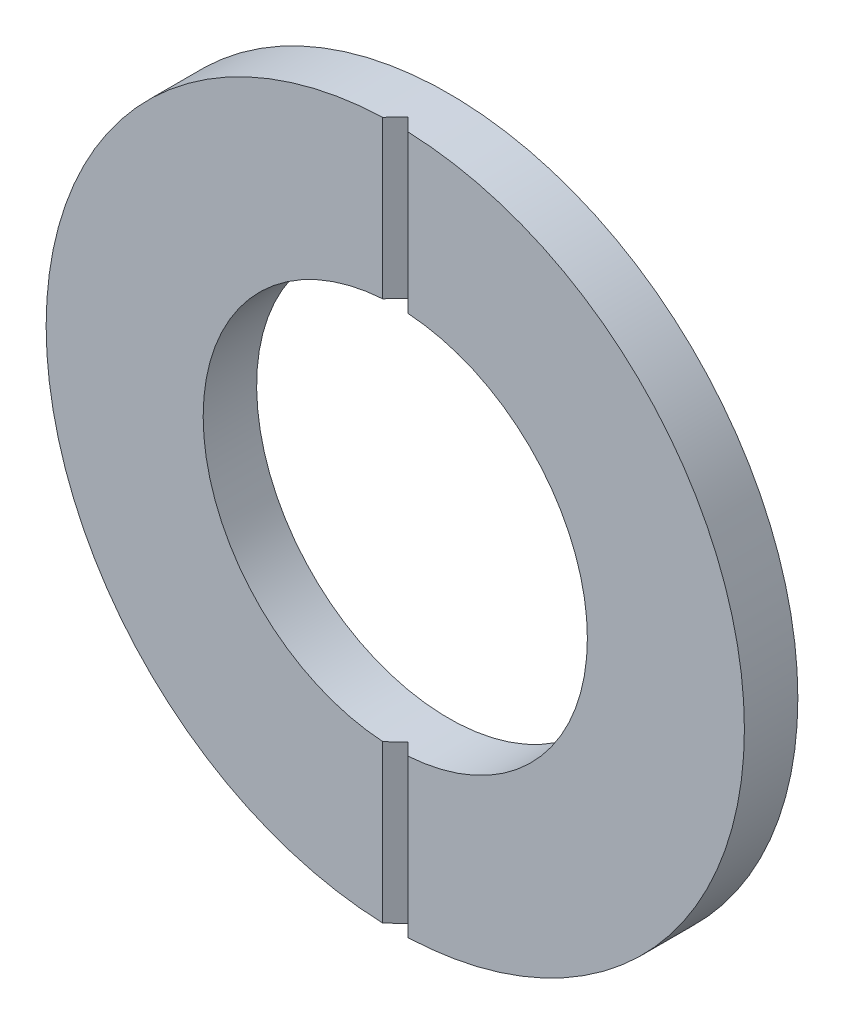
ISO-10303-21;
HEADER;
FILE_DESCRIPTION(('STEP AP214'),'2;1');
FILE_NAME('part.step','',(''),(''),'','','');
FILE_SCHEMA(('AUTOMOTIVE_DESIGN { 1 0 10303 214 1 1 1 1 }'));
ENDSEC;
DATA;
#1=APPLICATION_CONTEXT('core data for automotive mechanical design processes');
#2=APPLICATION_PROTOCOL_DEFINITION('international standard','automotive_design',2000,#1);
#3=PRODUCT_CONTEXT('',#1,'mechanical');
#4=PRODUCT('Part','Part','',(#3));
#5=PRODUCT_RELATED_PRODUCT_CATEGORY('part','',(#4));
#6=PRODUCT_DEFINITION_FORMATION('','',#4);
#7=PRODUCT_DEFINITION_CONTEXT('part definition',#1,'design');
#8=PRODUCT_DEFINITION('design','',#6,#7);
#9=PRODUCT_DEFINITION_SHAPE('','',#8);
#10=(LENGTH_UNIT() NAMED_UNIT(*) SI_UNIT(.MILLI.,.METRE.));
#11=(NAMED_UNIT(*) PLANE_ANGLE_UNIT() SI_UNIT($,.RADIAN.));
#12=(NAMED_UNIT(*) SI_UNIT($,.STERADIAN.) SOLID_ANGLE_UNIT());
#13=UNCERTAINTY_MEASURE_WITH_UNIT(LENGTH_MEASURE(1.E-05),#10,'distance_accuracy_value','');
#14=(GEOMETRIC_REPRESENTATION_CONTEXT(3) GLOBAL_UNCERTAINTY_ASSIGNED_CONTEXT((#13)) GLOBAL_UNIT_ASSIGNED_CONTEXT((#10,
#11,#12)) REPRESENTATION_CONTEXT('',''));
#15=CARTESIAN_POINT('',(0.,0.,0.));
#16=DIRECTION('',(0.,0.,1.));
#17=DIRECTION('',(1.,0.,0.));
#18=AXIS2_PLACEMENT_3D('',#15,#16,#17);
#19=CARTESIAN_POINT('',(2.66453525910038E-12,6.21724893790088E-12,0.406399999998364));
#20=DIRECTION('',(0.,0.,0.99999999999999));
#21=DIRECTION('',(1.00000000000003,0.,0.));
#22=AXIS2_PLACEMENT_3D('',#19,#20,#21);
#23=PLANE('',#22);
#24=DIRECTION('',(0.,1.00000000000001,0.));
#25=VECTOR('',#24,1.);
#26=CARTESIAN_POINT('',(-0.0952499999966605,-2.65429999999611,0.406399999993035));
#27=LINE('',#26,#25);
#28=CARTESIAN_POINT('',(-0.095249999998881,1.45739071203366,0.40639999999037));
#29=VERTEX_POINT('',#28);
#30=CARTESIAN_POINT('',(-0.0952500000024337,2.65259041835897,0.406399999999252));
#31=VERTEX_POINT('',#30);
#32=EDGE_CURVE('E144',#29,#31,#27,.T.);
#33=ORIENTED_EDGE('',*,*,#32,.T.);
#34=CARTESIAN_POINT('',(2.66453525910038E-12,6.21724893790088E-12,0.406399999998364));
#35=DIRECTION('',(0.,0.,0.99999999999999));
#36=DIRECTION('',(1.00000000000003,0.,0.));
#37=AXIS2_PLACEMENT_3D('',#34,#35,#36);
#38=CIRCLE('',#37,2.6543);
#39=CARTESIAN_POINT('',(-0.0952499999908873,-2.65259041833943,0.406399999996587));
#40=VERTEX_POINT('',#39);
#41=EDGE_CURVE('E110',#31,#40,#38,.T.);
#42=ORIENTED_EDGE('',*,*,#41,.T.);
#43=CARTESIAN_POINT('',(-0.0952499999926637,-1.45739071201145,0.406400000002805));
#44=VERTEX_POINT('',#43);
#45=EDGE_CURVE('E133',#40,#44,#27,.T.);
#46=ORIENTED_EDGE('',*,*,#45,.T.);
#47=CARTESIAN_POINT('',(2.66453525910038E-12,6.21724893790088E-12,0.406399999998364));
#48=DIRECTION('',(0.,0.,0.99999999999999));
#49=DIRECTION('',(1.00000000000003,0.,0.));
#50=AXIS2_PLACEMENT_3D('',#47,#48,#49);
#51=CIRCLE('',#50,1.4605);
#52=EDGE_CURVE('E119',#29,#44,#51,.T.);
#53=ORIENTED_EDGE('',*,*,#52,.F.);
#54=EDGE_LOOP('',(#33,#42,#46,#53));
#55=FACE_BOUND('',#54,.T.);
#56=ADVANCED_FACE('F36',(#55),#23,.T.);
#57=DIRECTION('',(0.,1.00000000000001,0.));
#58=VECTOR('',#57,1.);
#59=CARTESIAN_POINT('',(0.0952500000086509,-2.6542999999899,0.406399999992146));
#60=LINE('',#59,#58);
#61=CARTESIAN_POINT('',(0.0952500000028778,-2.65259041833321,0.406399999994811));
#62=VERTEX_POINT('',#61);
#63=CARTESIAN_POINT('',(0.0952500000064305,-1.45739071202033,0.406399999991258));
#64=VERTEX_POINT('',#63);
#65=EDGE_CURVE('E59',#62,#64,#60,.T.);
#66=ORIENTED_EDGE('',*,*,#65,.F.);
#67=CARTESIAN_POINT('',(0.0952499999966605,2.65259041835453,0.406400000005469));
#68=VERTEX_POINT('',#67);
#69=EDGE_CURVE('E122',#62,#68,#38,.T.);
#70=ORIENTED_EDGE('',*,*,#69,.T.);
#71=CARTESIAN_POINT('',(0.0952500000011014,1.4573907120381,0.406399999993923));
#72=VERTEX_POINT('',#71);
#73=EDGE_CURVE('E90',#72,#68,#60,.T.);
#74=ORIENTED_EDGE('',*,*,#73,.F.);
#75=EDGE_CURVE('E116',#64,#72,#51,.T.);
#76=ORIENTED_EDGE('',*,*,#75,.F.);
#77=EDGE_LOOP('',(#66,#70,#74,#76));
#78=FACE_BOUND('',#77,.T.);
#79=ADVANCED_FACE('F132',(#78),#23,.T.);
#80=CARTESIAN_POINT('',(0.,0.,0.));
#81=DIRECTION('',(0.,0.,0.99999999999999));
#82=DIRECTION('',(1.00000000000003,0.,0.));
#83=AXIS2_PLACEMENT_3D('',#80,#81,#82);
#84=PLANE('',#83);
#85=CARTESIAN_POINT('',(0.,0.,0.));
#86=DIRECTION('',(0.,0.,0.99999999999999));
#87=DIRECTION('',(1.00000000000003,0.,0.));
#88=AXIS2_PLACEMENT_3D('',#85,#86,#87);
#89=CIRCLE('',#88,2.6543);
#90=CARTESIAN_POINT('',(2.65430000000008,0.,0.));
#91=VERTEX_POINT('',#90);
#92=EDGE_CURVE('E124',#91,#91,#89,.T.);
#93=ORIENTED_EDGE('',*,*,#92,.F.);
#94=EDGE_LOOP('',(#93));
#95=FACE_BOUND('',#94,.T.);
#96=CARTESIAN_POINT('',(0.,0.,0.));
#97=DIRECTION('',(0.,0.,0.99999999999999));
#98=DIRECTION('',(1.00000000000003,0.,0.));
#99=AXIS2_PLACEMENT_3D('',#96,#97,#98);
#100=CIRCLE('',#99,1.4605);
#101=CARTESIAN_POINT('',(1.46050000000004,0.,0.));
#102=VERTEX_POINT('',#101);
#103=EDGE_CURVE('E113',#102,#102,#100,.T.);
#104=ORIENTED_EDGE('',*,*,#103,.T.);
#105=EDGE_LOOP('',(#104));
#106=FACE_BOUND('',#105,.T.);
#107=ADVANCED_FACE('F160',(#95,#106),#84,.F.);
#108=CARTESIAN_POINT('',(2.66453525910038E-12,6.21724893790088E-12,0.406399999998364));
#109=DIRECTION('',(0.,0.,-0.99999999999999));
#110=DIRECTION('',(-1.00000000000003,0.,0.));
#111=AXIS2_PLACEMENT_3D('',#108,#109,#110);
#112=CYLINDRICAL_SURFACE('',#111,2.6543);
#113=CARTESIAN_POINT('',(9.76996261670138E-12,5.32907051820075E-12,0.311149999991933));
#114=DIRECTION('',(0.707106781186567,0.,-0.707106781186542));
#115=DIRECTION('',(-0.707106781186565,0.,-0.707106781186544));
#116=AXIS2_PLACEMENT_3D('',#113,#114,#115);
#117=ELLIPSE('',#116,3.75374705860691,2.6543);
#118=CARTESIAN_POINT('',(4.44089209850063E-12,-2.65429999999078,0.311149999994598));
#119=VERTEX_POINT('',#118);
#120=EDGE_CURVE('E96',#62,#119,#117,.T.);
#121=ORIENTED_EDGE('',*,*,#120,.T.);
#122=CARTESIAN_POINT('',(9.76996261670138E-12,5.32907051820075E-12,0.311149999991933));
#123=DIRECTION('',(-0.707106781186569,0.,-0.70710678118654));
#124=DIRECTION('',(0.707106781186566,0.,-0.707106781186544));
#125=AXIS2_PLACEMENT_3D('',#122,#123,#124);
#126=ELLIPSE('',#125,3.75374705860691,2.6543);
#127=EDGE_CURVE('E111',#119,#40,#126,.T.);
#128=ORIENTED_EDGE('',*,*,#127,.T.);
#129=ORIENTED_EDGE('',*,*,#41,.F.);
#130=CARTESIAN_POINT('',(2.22044604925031E-12,2.65430000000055,0.311149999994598));
#131=VERTEX_POINT('',#130);
#132=EDGE_CURVE('E95',#31,#131,#126,.T.);
#133=ORIENTED_EDGE('',*,*,#132,.T.);
#134=EDGE_CURVE('E87',#131,#68,#117,.T.);
#135=ORIENTED_EDGE('',*,*,#134,.T.);
#136=ORIENTED_EDGE('',*,*,#69,.F.);
#137=EDGE_LOOP('',(#121,#128,#129,#133,#135,#136));
#138=FACE_BOUND('',#137,.T.);
#139=ORIENTED_EDGE('',*,*,#92,.T.);
#140=EDGE_LOOP('',(#139));
#141=FACE_BOUND('',#140,.T.);
#142=ADVANCED_FACE('F38',(#138,#141),#112,.T.);
#143=CARTESIAN_POINT('',(2.66453525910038E-12,6.21724893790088E-12,0.406399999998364));
#144=DIRECTION('',(0.,0.,-0.99999999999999));
#145=DIRECTION('',(-1.00000000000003,0.,0.));
#146=AXIS2_PLACEMENT_3D('',#143,#144,#145);
#147=CYLINDRICAL_SURFACE('',#146,1.4605);
#148=CARTESIAN_POINT('',(9.76996261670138E-12,5.32907051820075E-12,0.311149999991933));
#149=DIRECTION('',(-0.707106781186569,0.,-0.70710678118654));
#150=DIRECTION('',(0.707106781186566,0.,-0.707106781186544));
#151=AXIS2_PLACEMENT_3D('',#148,#149,#150);
#152=ELLIPSE('',#151,2.06545890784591,1.4605);
#153=CARTESIAN_POINT('',(4.44089209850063E-13,1.4605000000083,0.311149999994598));
#154=VERTEX_POINT('',#153);
#155=EDGE_CURVE('E11',#29,#154,#152,.T.);
#156=ORIENTED_EDGE('',*,*,#155,.F.);
#157=ORIENTED_EDGE('',*,*,#52,.T.);
#158=CARTESIAN_POINT('',(0.,-1.46049999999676,0.311149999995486));
#159=VERTEX_POINT('',#158);
#160=EDGE_CURVE('E40',#159,#44,#152,.T.);
#161=ORIENTED_EDGE('',*,*,#160,.F.);
#162=CARTESIAN_POINT('',(9.76996261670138E-12,5.32907051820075E-12,0.311149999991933));
#163=DIRECTION('',(0.707106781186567,0.,-0.707106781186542));
#164=DIRECTION('',(-0.707106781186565,0.,-0.707106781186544));
#165=AXIS2_PLACEMENT_3D('',#162,#163,#164);
#166=ELLIPSE('',#165,2.06545890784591,1.4605);
#167=EDGE_CURVE('E126',#64,#159,#166,.T.);
#168=ORIENTED_EDGE('',*,*,#167,.F.);
#169=ORIENTED_EDGE('',*,*,#75,.T.);
#170=EDGE_CURVE('E45',#154,#72,#166,.T.);
#171=ORIENTED_EDGE('',*,*,#170,.F.);
#172=EDGE_LOOP('',(#156,#157,#161,#168,#169,#171));
#173=FACE_BOUND('',#172,.T.);
#174=ORIENTED_EDGE('',*,*,#103,.F.);
#175=EDGE_LOOP('',(#174));
#176=FACE_BOUND('',#175,.T.);
#177=ADVANCED_FACE('F135',(#173,#176),#147,.F.);
#178=CARTESIAN_POINT('',(4.44089209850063E-12,-2.65429999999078,0.311149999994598));
#179=DIRECTION('',(0.707106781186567,0.,-0.707106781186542));
#180=DIRECTION('',(-0.707106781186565,0.,-0.707106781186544));
#181=AXIS2_PLACEMENT_3D('',#178,#179,#180);
#182=PLANE('',#181);
#183=ORIENTED_EDGE('',*,*,#65,.T.);
#184=ORIENTED_EDGE('',*,*,#167,.T.);
#185=DIRECTION('',(0.,1.00000000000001,0.));
#186=VECTOR('',#185,1.);
#187=CARTESIAN_POINT('',(4.44089209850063E-12,-2.65429999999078,0.311149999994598));
#188=LINE('',#187,#186);
#189=EDGE_CURVE('E103',#119,#159,#188,.T.);
#190=ORIENTED_EDGE('',*,*,#189,.F.);
#191=ORIENTED_EDGE('',*,*,#120,.F.);
#192=EDGE_LOOP('',(#183,#184,#190,#191));
#193=FACE_BOUND('',#192,.T.);
#194=ADVANCED_FACE('F145',(#193),#182,.F.);
#195=CARTESIAN_POINT('',(-0.0952499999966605,-2.65429999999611,0.406399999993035));
#196=DIRECTION('',(-0.707106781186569,0.,-0.70710678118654));
#197=DIRECTION('',(-0.707106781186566,0.,0.707106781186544));
#198=AXIS2_PLACEMENT_3D('',#195,#196,#197);
#199=PLANE('',#198);
#200=ORIENTED_EDGE('',*,*,#189,.T.);
#201=ORIENTED_EDGE('',*,*,#160,.T.);
#202=ORIENTED_EDGE('',*,*,#45,.F.);
#203=ORIENTED_EDGE('',*,*,#127,.F.);
#204=EDGE_LOOP('',(#200,#201,#202,#203));
#205=FACE_BOUND('',#204,.T.);
#206=ADVANCED_FACE('F142',(#205),#199,.F.);
#207=ORIENTED_EDGE('',*,*,#32,.F.);
#208=ORIENTED_EDGE('',*,*,#155,.T.);
#209=EDGE_CURVE('E52',#154,#131,#188,.T.);
#210=ORIENTED_EDGE('',*,*,#209,.T.);
#211=ORIENTED_EDGE('',*,*,#132,.F.);
#212=EDGE_LOOP('',(#207,#208,#210,#211));
#213=FACE_BOUND('',#212,.T.);
#214=ADVANCED_FACE('F99',(#213),#199,.F.);
#215=ORIENTED_EDGE('',*,*,#209,.F.);
#216=ORIENTED_EDGE('',*,*,#170,.T.);
#217=ORIENTED_EDGE('',*,*,#73,.T.);
#218=ORIENTED_EDGE('',*,*,#134,.F.);
#219=EDGE_LOOP('',(#215,#216,#217,#218));
#220=FACE_BOUND('',#219,.T.);
#221=ADVANCED_FACE('F88',(#220),#182,.F.);
#222=CLOSED_SHELL('',(#56,#79,#107,#142,#177,#194,#206,#214,#221));
#223=MANIFOLD_SOLID_BREP('B2',#222);
#224=ADVANCED_BREP_SHAPE_REPRESENTATION('',(#18,#223),#14);
#225=SHAPE_DEFINITION_REPRESENTATION(#9,#224);
ENDSEC;
END-ISO-10303-21;
